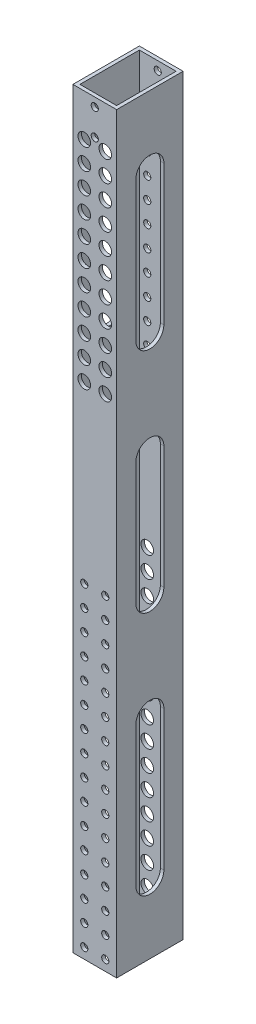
from build123d import *

# Parameters (mm, degrees)
SKETCH_1_W           = 25
SKETCH_1_H           = 38
SKETCH_1_W_2         = 21
SKETCH_1_H_2         = 34
EXTRUDE_1_DEPTH      = 215
SKETCH_2_R           = 2.05
CUT_EXTRUDE_1_DEPTH  = 300
SKETCH_3_R           = 8
CUT_EXTRUDE_2_DEPTH  = 218.280924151
CUT_EXTRUDE_START    = -38
CUT_EXTRUDE_4_DEPTH  = 38
SKETCH_8_R           = 2.05
CUT_EXTRUDE_7_DEPTH  = 67
CUT_EXTRUDE_START_2  = -25
CUT_EXTRUDE_8_DEPTH  = 25
CUT_EXTRUDE_START_3  = -5
SKETCH_11_R          = 3.6
CUT_EXTRUDE_9_DEPTH  = 48
SKETCH_12_R          = 3.6
CUT_EXTRUDE_10_DEPTH = 10


with BuildPart() as part:
    # Sketch 1 → Extrude 1 (new, symmetric)
    with BuildSketch(Plane(origin=(0, 0, 0), x_dir=(1, 0, 0), z_dir=(0, 1, 0))):
        Rectangle(SKETCH_1_W, SKETCH_1_H)
        Rectangle(SKETCH_1_W_2, SKETCH_1_H_2, mode=Mode.SUBTRACT)
    extrude(amount=EXTRUDE_1_DEPTH, both=True)

    # Sketch 2 → Cut-Extrude 1 (cut)
    with BuildSketch(Plane.XY.offset(19)):
        with Locations((0, 195)):
            Circle(SKETCH_2_R)
        with Locations((0, 210)):
            Circle(SKETCH_2_R)
    extrude(amount=-CUT_EXTRUDE_1_DEPTH, mode=Mode.SUBTRACT)

    # Sketch 3 → Cut-Extrude 2 (cut, through all)
    with BuildSketch(Plane.ZY.offset(12.5)):
        with Locations((0, 35)):
            Circle(SKETCH_3_R)
        with Locations(Location((0, -35, 0), (0, 0, 180))):
            Circle(SKETCH_3_R)
    extrude(amount=-CUT_EXTRUDE_2_DEPTH, mode=Mode.SUBTRACT)

    # Sketch 5 → Cut-Extrude 4 (cut)
    with BuildSketch(Plane(origin=(12.5, 0, 0), x_dir=(0, 0, -1), z_dir=(1, 0, 0)).offset(CUT_EXTRUDE_START)):
        with BuildLine():
            Line((-8, 35), (-8, -35))
            ThreePointArc((-8, -35), (0, -43), (8, -35))
            Line((8, -35), (8, 35))
            ThreePointArc((8, 35), (0, 43), (-8, 35))
        make_face()
    extrude(amount=CUT_EXTRUDE_4_DEPTH, mode=Mode.SUBTRACT)

    # Sketch 8 → Cut-Extrude 7 (cut)
    with BuildSketch(Plane.XY.offset(19)):
        with Locations((-6, -209)):
            Circle(SKETCH_8_R)
        with Locations(Location((6, -209, 0), (0, 0, 180))):
            Circle(SKETCH_8_R)
        with Locations((-6, -197)):
            Circle(SKETCH_8_R)
        with Locations(Location((6, -197, 0), (0, 0, 180))):
            Circle(SKETCH_8_R)
        with Locations((-6, -185)):
            Circle(SKETCH_8_R)
        with Locations(Location((6, -185, 0), (0, 0, 180))):
            Circle(SKETCH_8_R)
        with Locations((-6, -173)):
            Circle(SKETCH_8_R)
        with Locations(Location((6, -173, 0), (0, 0, 180))):
            Circle(SKETCH_8_R)
        with Locations((-6, -161)):
            Circle(SKETCH_8_R)
        with Locations(Location((6, -161, 0), (0, 0, 180))):
            Circle(SKETCH_8_R)
        with Locations((-6, -149)):
            Circle(SKETCH_8_R)
        with Locations(Location((6, -149, 0), (0, 0, 180))):
            Circle(SKETCH_8_R)
        with Locations((-6, -137)):
            Circle(SKETCH_8_R)
        with Locations(Location((6, -137, 0), (0, 0, 180))):
            Circle(SKETCH_8_R)
        with Locations((-6, -125)):
            Circle(SKETCH_8_R)
        with Locations(Location((6, -125, 0), (0, 0, 180))):
            Circle(SKETCH_8_R)
        with Locations((-6, -113)):
            Circle(SKETCH_8_R)
        with Locations(Location((6, -113, 0), (0, 0, 180))):
            Circle(SKETCH_8_R)
        with Locations((-6, -101)):
            Circle(SKETCH_8_R)
        with Locations(Location((6, -101, 0), (0, 0, 180))):
            Circle(SKETCH_8_R)
        with Locations((-6, -89)):
            Circle(SKETCH_8_R)
        with Locations(Location((6, -89, 0), (0, 0, 180))):
            Circle(SKETCH_8_R)
        with Locations((-6, -77)):
            Circle(SKETCH_8_R)
        with Locations(Location((6, -77, 0), (0, 0, 180))):
            Circle(SKETCH_8_R)
        with Locations((-6, -65)):
            Circle(SKETCH_8_R)
        with Locations(Location((6, -65, 0), (0, 0, 180))):
            Circle(SKETCH_8_R)
        with Locations((-6, -53)):
            Circle(SKETCH_8_R)
        with Locations(Location((6, -53, 0), (0, 0, 180))):
            Circle(SKETCH_8_R)
        with Locations((-6, 71)):
            Circle(SKETCH_8_R)
        with Locations(Location((6, 71, 0), (0, 0, 180))):
            Circle(SKETCH_8_R)
        with Locations((-6, 83)):
            Circle(SKETCH_8_R)
        with Locations(Location((6, 83, 0), (0, 0, 180))):
            Circle(SKETCH_8_R)
        with Locations((-6, 95)):
            Circle(SKETCH_8_R)
        with Locations(Location((6, 95, 0), (0, 0, 180))):
            Circle(SKETCH_8_R)
        with Locations((-6, 107)):
            Circle(SKETCH_8_R)
        with Locations(Location((6, 107, 0), (0, 0, 180))):
            Circle(SKETCH_8_R)
        with Locations((-6, -41)):
            Circle(SKETCH_8_R)
        with Locations(Location((6, -41, 0), (0, 0, 180))):
            Circle(SKETCH_8_R)
        with Locations((-6, -29)):
            Circle(SKETCH_8_R)
        with Locations(Location((6, -29, 0), (0, 0, 180))):
            Circle(SKETCH_8_R)
        with Locations((-6, 119)):
            Circle(SKETCH_8_R)
        with Locations(Location((6, 119, 0), (0, 0, 180))):
            Circle(SKETCH_8_R)
        with Locations((-6, 131)):
            Circle(SKETCH_8_R)
        with Locations(Location((6, 131, 0), (0, 0, 180))):
            Circle(SKETCH_8_R)
        with Locations((-6, 143)):
            Circle(SKETCH_8_R)
        with Locations(Location((6, 143, 0), (0, 0, 180))):
            Circle(SKETCH_8_R)
        with Locations((-6, 155)):
            Circle(SKETCH_8_R)
        with Locations(Location((6, 155, 0), (0, 0, 180))):
            Circle(SKETCH_8_R)
        with Locations((-6, 167)):
            Circle(SKETCH_8_R)
        with Locations(Location((6, 167, 0), (0, 0, 180))):
            Circle(SKETCH_8_R)
        with Locations((-6, 179)):
            Circle(SKETCH_8_R)
        with Locations(Location((6, 179, 0), (0, 0, 180))):
            Circle(SKETCH_8_R)
        with Locations((-6, 191)):
            Circle(SKETCH_8_R)
        with Locations(Location((6, 191, 0), (0, 0, 180))):
            Circle(SKETCH_8_R)
    extrude(amount=-CUT_EXTRUDE_7_DEPTH, mode=Mode.SUBTRACT)

    # Sketch 9 → Cut-Extrude 8 (cut)
    with BuildSketch(Plane.ZY.offset(12.5).offset(CUT_EXTRUDE_START_2)):
        with BuildLine():
            Line((8, 175), (8, 95))
            ThreePointArc((8, 95), (0, 87), (-8, 95))
            Line((-8, 95), (-8, 175))
            ThreePointArc((-8, 175), (0, 183), (8, 175))
        make_face()
        with BuildLine():
            Line((8, -175), (8, -95))
            ThreePointArc((8, -95), (0, -87), (-8, -95))
            Line((-8, -95), (-8, -175))
            ThreePointArc((-8, -175), (0, -183), (8, -175))
        make_face()
    extrude(amount=CUT_EXTRUDE_8_DEPTH, mode=Mode.SUBTRACT)

    # Sketch 11 → Cut-Extrude 9 (cut)
    with BuildSketch(Plane.XY.offset(19).offset(CUT_EXTRUDE_START_3)):
        with Locations((6, -209)):
            Circle(SKETCH_11_R)
        with Locations((-6, -209)):
            Circle(SKETCH_11_R)
        with Locations((-6, -197)):
            Circle(SKETCH_11_R)
        with Locations((6, -197)):
            Circle(SKETCH_11_R)
        with Locations((-6, -185)):
            Circle(SKETCH_11_R)
        with Locations((6, -185)):
            Circle(SKETCH_11_R)
        with Locations((-6, -173)):
            Circle(SKETCH_11_R)
        with Locations((6, -173)):
            Circle(SKETCH_11_R)
        with Locations((-6, -161)):
            Circle(SKETCH_11_R)
        with Locations((6, -161)):
            Circle(SKETCH_11_R)
        with Locations((-6, -149)):
            Circle(SKETCH_11_R)
        with Locations((6, -149)):
            Circle(SKETCH_11_R)
        with Locations((-6, -137)):
            Circle(SKETCH_11_R)
        with Locations((6, -137)):
            Circle(SKETCH_11_R)
        with Locations((-6, -125)):
            Circle(SKETCH_11_R)
        with Locations((6, -125)):
            Circle(SKETCH_11_R)
        with Locations((-6, -113)):
            Circle(SKETCH_11_R)
        with Locations((6, -113)):
            Circle(SKETCH_11_R)
        with Locations((-6, -101)):
            Circle(SKETCH_11_R)
        with Locations((6, -101)):
            Circle(SKETCH_11_R)
        with Locations((-6, -89)):
            Circle(SKETCH_11_R)
        with Locations((6, -89)):
            Circle(SKETCH_11_R)
        with Locations((-6, -77)):
            Circle(SKETCH_11_R)
        with Locations((6, -77)):
            Circle(SKETCH_11_R)
        with Locations((-6, -65)):
            Circle(SKETCH_11_R)
        with Locations((6, -65)):
            Circle(SKETCH_11_R)
        with Locations((-6, -53)):
            Circle(SKETCH_11_R)
        with Locations((6, -53)):
            Circle(SKETCH_11_R)
        with Locations((-6, -41)):
            Circle(SKETCH_11_R)
        with Locations((6, -41)):
            Circle(SKETCH_11_R)
        with Locations((-6, -29)):
            Circle(SKETCH_11_R)
        with Locations((6, -29)):
            Circle(SKETCH_11_R)
    extrude(amount=-CUT_EXTRUDE_9_DEPTH, mode=Mode.SUBTRACT)

    # Sketch 12 → Cut-Extrude 10 (cut)
    with BuildSketch(Plane.XY.offset(19)):
        with Locations((-6, 191)):
            Circle(SKETCH_12_R)
        with Locations((6, 191)):
            Circle(SKETCH_12_R)
        with Locations((-6, 179)):
            Circle(SKETCH_12_R)
        with Locations((6, 179)):
            Circle(SKETCH_12_R)
        with Locations((-6, 167)):
            Circle(SKETCH_12_R)
        with Locations((6, 167)):
            Circle(SKETCH_12_R)
        with Locations((-6, 155)):
            Circle(SKETCH_12_R)
        with Locations((6, 155)):
            Circle(SKETCH_12_R)
        with Locations((-6, 143)):
            Circle(SKETCH_12_R)
        with Locations((6, 143)):
            Circle(SKETCH_12_R)
        with Locations((-6, 131)):
            Circle(SKETCH_12_R)
        with Locations((6, 131)):
            Circle(SKETCH_12_R)
        with Locations((-6, 119)):
            Circle(SKETCH_12_R)
        with Locations((6, 119)):
            Circle(SKETCH_12_R)
        with Locations((-6, 107)):
            Circle(SKETCH_12_R)
        with Locations((6, 107)):
            Circle(SKETCH_12_R)
        with Locations((-6, 95)):
            Circle(SKETCH_12_R)
        with Locations((6, 95)):
            Circle(SKETCH_12_R)
        with Locations((-6, 83)):
            Circle(SKETCH_12_R)
        with Locations((6, 83)):
            Circle(SKETCH_12_R)
        with Locations((-6, 71)):
            Circle(SKETCH_12_R)
        with Locations((6, 71)):
            Circle(SKETCH_12_R)
    extrude(amount=-CUT_EXTRUDE_10_DEPTH, mode=Mode.SUBTRACT)


solid = part.part
